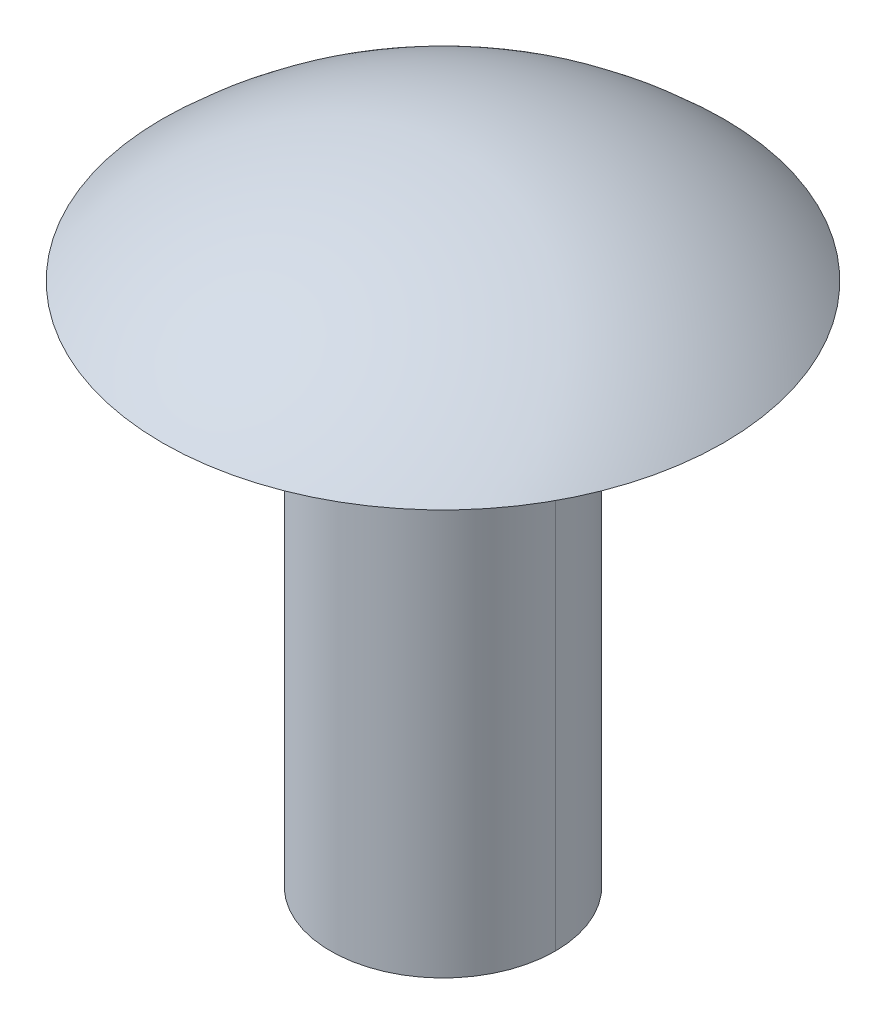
ISO-10303-21;
HEADER;
FILE_DESCRIPTION(('STEP AP214'),'2;1');
FILE_NAME('part.step','',(''),(''),'','','');
FILE_SCHEMA(('AUTOMOTIVE_DESIGN { 1 0 10303 214 1 1 1 1 }'));
ENDSEC;
DATA;
#1=APPLICATION_CONTEXT('core data for automotive mechanical design processes');
#2=APPLICATION_PROTOCOL_DEFINITION('international standard','automotive_design',2000,#1);
#3=PRODUCT_CONTEXT('',#1,'mechanical');
#4=PRODUCT('Part','Part','',(#3));
#5=PRODUCT_RELATED_PRODUCT_CATEGORY('part','',(#4));
#6=PRODUCT_DEFINITION_FORMATION('','',#4);
#7=PRODUCT_DEFINITION_CONTEXT('part definition',#1,'design');
#8=PRODUCT_DEFINITION('design','',#6,#7);
#9=PRODUCT_DEFINITION_SHAPE('','',#8);
#10=(LENGTH_UNIT() NAMED_UNIT(*) SI_UNIT(.MILLI.,.METRE.));
#11=(NAMED_UNIT(*) PLANE_ANGLE_UNIT() SI_UNIT($,.RADIAN.));
#12=(NAMED_UNIT(*) SI_UNIT($,.STERADIAN.) SOLID_ANGLE_UNIT());
#13=UNCERTAINTY_MEASURE_WITH_UNIT(LENGTH_MEASURE(1.E-05),#10,'distance_accuracy_value','');
#14=(GEOMETRIC_REPRESENTATION_CONTEXT(3) GLOBAL_UNCERTAINTY_ASSIGNED_CONTEXT((#13)) GLOBAL_UNIT_ASSIGNED_CONTEXT((#10,
#11,#12)) REPRESENTATION_CONTEXT('',''));
#15=CARTESIAN_POINT('',(0.,0.,0.));
#16=DIRECTION('',(0.,0.,1.));
#17=DIRECTION('',(1.,0.,0.));
#18=AXIS2_PLACEMENT_3D('',#15,#16,#17);
#19=CARTESIAN_POINT('',(0.,-22.2377,0.));
#20=DIRECTION('',(0.,1.,0.));
#21=DIRECTION('',(0.,0.,1.));
#22=AXIS2_PLACEMENT_3D('',#19,#20,#21);
#23=PLANE('',#22);
#24=DIRECTION('',(-1.,0.,0.));
#25=VECTOR('',#24,1.);
#26=CARTESIAN_POINT('',(0.,-22.2377,0.));
#27=LINE('',#26,#25);
#28=CARTESIAN_POINT('',(4.7625,-22.2377,0.));
#29=VERTEX_POINT('',#28);
#30=CARTESIAN_POINT('',(-4.7625,-22.2377,0.));
#31=VERTEX_POINT('',#30);
#32=EDGE_CURVE('E11',#29,#31,#27,.T.);
#33=ORIENTED_EDGE('',*,*,#32,.F.);
#34=CARTESIAN_POINT('',(0.,-22.2377,0.));
#35=DIRECTION('',(0.,1.,0.));
#36=DIRECTION('',(0.,0.,1.));
#37=AXIS2_PLACEMENT_3D('',#34,#35,#36);
#38=CIRCLE('',#37,4.7625);
#39=EDGE_CURVE('E74',#31,#29,#38,.T.);
#40=ORIENTED_EDGE('',*,*,#39,.F.);
#41=EDGE_LOOP('',(#33,#40));
#42=FACE_BOUND('',#41,.T.);
#43=ADVANCED_FACE('F37',(#42),#23,.F.);
#44=CARTESIAN_POINT('',(0.,0.,0.));
#45=DIRECTION('',(0.,1.,0.));
#46=DIRECTION('',(-1.,0.,0.));
#47=AXIS2_PLACEMENT_3D('',#44,#45,#46);
#48=PLANE('',#47);
#49=DIRECTION('',(-1.,0.,0.));
#50=VECTOR('',#49,1.);
#51=CARTESIAN_POINT('',(0.,0.,0.));
#52=LINE('',#51,#50);
#53=CARTESIAN_POINT('',(11.8999,0.,0.));
#54=VERTEX_POINT('',#53);
#55=CARTESIAN_POINT('',(4.7625,0.,0.));
#56=VERTEX_POINT('',#55);
#57=EDGE_CURVE('E47',#54,#56,#52,.T.);
#58=ORIENTED_EDGE('',*,*,#57,.F.);
#59=CARTESIAN_POINT('',(0.,0.,0.));
#60=DIRECTION('',(0.,1.,0.));
#61=DIRECTION('',(-1.,0.,0.));
#62=AXIS2_PLACEMENT_3D('',#59,#60,#61);
#63=CIRCLE('',#62,11.8999);
#64=CARTESIAN_POINT('',(-11.8999,0.,0.));
#65=VERTEX_POINT('',#64);
#66=EDGE_CURVE('E94',#65,#54,#63,.T.);
#67=ORIENTED_EDGE('',*,*,#66,.F.);
#68=CARTESIAN_POINT('',(-4.7625,0.,0.));
#69=VERTEX_POINT('',#68);
#70=EDGE_CURVE('E60',#69,#65,#52,.T.);
#71=ORIENTED_EDGE('',*,*,#70,.F.);
#72=CARTESIAN_POINT('',(0.,0.,0.));
#73=DIRECTION('',(0.,1.,0.));
#74=DIRECTION('',(0.,0.,1.));
#75=AXIS2_PLACEMENT_3D('',#72,#73,#74);
#76=CIRCLE('',#75,4.7625);
#77=EDGE_CURVE('E96',#69,#56,#76,.T.);
#78=ORIENTED_EDGE('',*,*,#77,.T.);
#79=EDGE_LOOP('',(#58,#67,#71,#78));
#80=FACE_BOUND('',#79,.T.);
#81=ADVANCED_FACE('F116',(#80),#48,.F.);
#82=CARTESIAN_POINT('',(0.,-22.2377,0.));
#83=DIRECTION('',(0.,1.,0.));
#84=DIRECTION('',(0.,0.,1.));
#85=AXIS2_PLACEMENT_3D('',#82,#83,#84);
#86=CYLINDRICAL_SURFACE('',#85,4.7625);
#87=ORIENTED_EDGE('',*,*,#77,.F.);
#88=DIRECTION('',(0.,1.,0.));
#89=VECTOR('',#88,1.);
#90=CARTESIAN_POINT('',(-4.7625,-22.2377,0.));
#91=LINE('',#90,#89);
#92=EDGE_CURVE('E88',#69,#31,#91,.F.);
#93=ORIENTED_EDGE('',*,*,#92,.T.);
#94=ORIENTED_EDGE('',*,*,#39,.T.);
#95=DIRECTION('',(0.,1.,0.));
#96=VECTOR('',#95,1.);
#97=CARTESIAN_POINT('',(4.7625,-22.2377,0.));
#98=LINE('',#97,#96);
#99=EDGE_CURVE('E41',#29,#56,#98,.T.);
#100=ORIENTED_EDGE('',*,*,#99,.T.);
#101=EDGE_LOOP('',(#87,#93,#94,#100));
#102=FACE_BOUND('',#101,.T.);
#103=ADVANCED_FACE('F89',(#102),#86,.T.);
#104=ORIENTED_EDGE('',*,*,#92,.F.);
#105=EDGE_CURVE('E84',#56,#69,#76,.T.);
#106=ORIENTED_EDGE('',*,*,#105,.F.);
#107=ORIENTED_EDGE('',*,*,#99,.F.);
#108=EDGE_CURVE('E83',#29,#31,#38,.T.);
#109=ORIENTED_EDGE('',*,*,#108,.T.);
#110=EDGE_LOOP('',(#104,#106,#107,#109));
#111=FACE_BOUND('',#110,.T.);
#112=ADVANCED_FACE('F39',(#111),#86,.T.);
#113=ORIENTED_EDGE('',*,*,#108,.F.);
#114=ORIENTED_EDGE('',*,*,#32,.T.);
#115=EDGE_LOOP('',(#113,#114));
#116=FACE_BOUND('',#115,.T.);
#117=ADVANCED_FACE('F91',(#116),#23,.F.);
#118=CARTESIAN_POINT('',(0.,-12.5317929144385,0.));
#119=DIRECTION('',(0.,1.,0.));
#120=DIRECTION('',(1.,0.,0.));
#121=AXIS2_PLACEMENT_3D('',#118,#119,#120);
#122=SPHERICAL_SURFACE('',#121,17.2815929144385);
#123=ORIENTED_EDGE('',*,*,#66,.T.);
#124=EDGE_CURVE('E112',#54,#65,#63,.T.);
#125=ORIENTED_EDGE('',*,*,#124,.T.);
#126=EDGE_LOOP('',(#123,#125));
#127=FACE_BOUND('',#126,.T.);
#128=ADVANCED_FACE('F115',(#127),#122,.T.);
#129=ORIENTED_EDGE('',*,*,#124,.F.);
#130=ORIENTED_EDGE('',*,*,#57,.T.);
#131=ORIENTED_EDGE('',*,*,#105,.T.);
#132=ORIENTED_EDGE('',*,*,#70,.T.);
#133=EDGE_LOOP('',(#129,#130,#131,#132));
#134=FACE_BOUND('',#133,.T.);
#135=ADVANCED_FACE('F111',(#134),#48,.F.);
#136=CLOSED_SHELL('',(#43,#81,#103,#112,#117,#128,#135));
#137=MANIFOLD_SOLID_BREP('B2',#136);
#138=ADVANCED_BREP_SHAPE_REPRESENTATION('',(#18,#137),#14);
#139=SHAPE_DEFINITION_REPRESENTATION(#9,#138);
ENDSEC;
END-ISO-10303-21;
